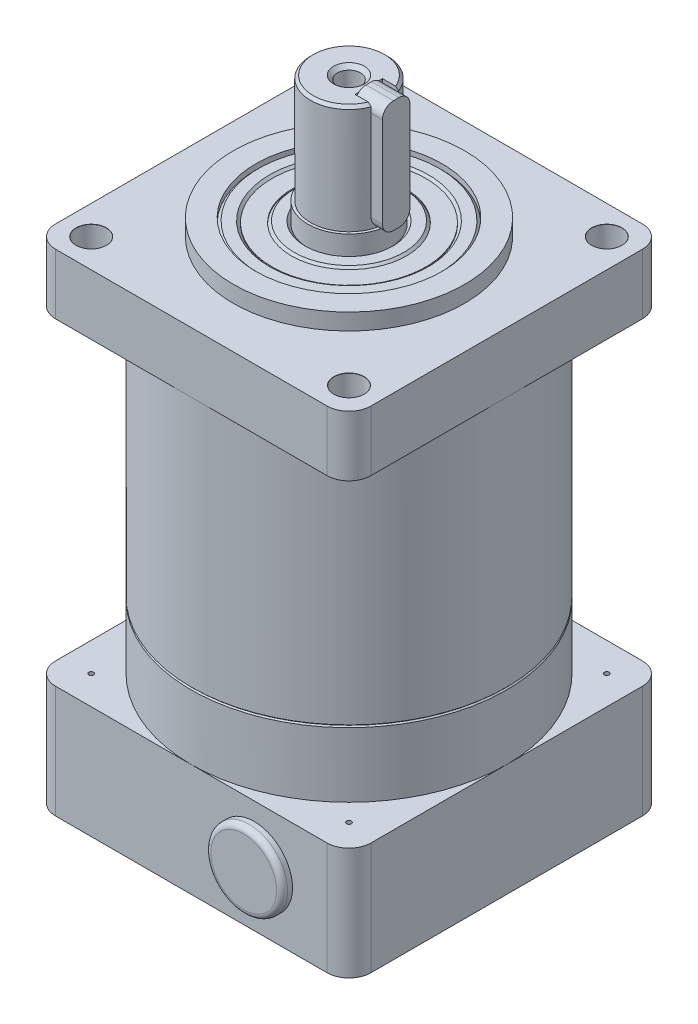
from build123d import *

# Parameters (mm, degrees)
SKETCH_1_W                       = 57.5
SKETCH_1_H                       = 57.5
EXTRUDE_1_DEPTH                  = 20.5
SKETCH_2_R                       = 28.75
EXTRUDE_2_DEPTH                  = 58
EXTRUDE_START                    = 78.5
SKETCH_1_2_W                     = 57.5
SKETCH_1_2_H                     = 57.5
EXTRUDE_3_DEPTH                  = 11
FILLET_1_R                       = 4
SKETCH_3_R                       = 19
CUT_EXTRUDE_1_DEPTH              = 4.5
SKETCH_4_R                       = 19
CUT_EXTRUDE_2_DEPTH              = 19
CUT_EXTRUDE_3_DEPTH              = 0.7
CUT_EXTRUDE_4_DEPTH              = 22
CUT_EXTRUDE_5_REACH              = 112.196
CUT_EXTRUDE_5_END_RADIUS         = 19
SKETCH_7_R                       = 4
SKETCH_8_R                       = 3.25
CUT_EXTRUDE_6_DEPTH              = 24.5
SKETCH_9_R                       = 3
EXTRUDE_5_DEPTH                  = 5
SKETCH_13_R                      = 17
SKETCH_13_R_2                    = 14
SKETCH_13_R_3                    = 10.5
SKETCH_13_R_4                    = 7.5
EXTRUDE_8_DEPTH                  = 2.5
CHAMFER_1_SIZE                   = 0.5
SKETCH_13_5_R                    = 7.5
SKETCH_13_5_R_2                  = 7
EXTRUDE_9_DEPTH                  = 5.7
SKETCH_13_6_R                    = 7
EXTRUDE_10_DEPTH                 = 25.5
SKETCH_13_7_R                    = 14
SKETCH_13_7_R_2                  = 10.5
EXTRUDE_11_DEPTH                 = 2.2
SKETCH_13_8_R                    = 21.1
SKETCH_13_8_R_2                  = 17
EXTRUDE_12_DEPTH                 = 3
CHAMFER_2_SIZE                   = 0.5
HOLE_WIZARD_M51_D                = 4.2
HOLE_WIZARD_M51_DEPTH            = 19.5
HOLE_WIZARD_M51_CSINK_D          = 5.6
HOLE_WIZARD_M51_CSINK_ANGLE      = 90
HOLE_WIZARD_M51_TIP              = 1.2618073
CUT_EXTRUDE_7_REACH              = 127.576
CUT_EXTRUDE_START                = 3.6
EXTRUDE_13_DEPTH                 = 5
HOLE_WIZARD_M52_D                = 4.2
HOLE_WIZARD_M52_DEPTH            = 19.5
HOLE_WIZARD_M52_CSINK_D          = 5.6
HOLE_WIZARD_M52_CSINK_ANGLE      = 90
HOLE_WIZARD_M52_TIP              = 1.2618073
HOLE_WIZARD_5_5_5_5_1_AT_2_COUNT = 2
HOLE_WIZARD_5_5_5_5_1_AT_2_PITCH = 47
HOLE_WIZARD_5_5_5_5_1_AT_3_COUNT = 2
HOLE_WIZARD_5_5_5_5_1_AT_3_PITCH = 47
HOLE_WIZARD_5_5_5_5_1_AT_4_COUNT = 2
HOLE_WIZARD_5_5_5_5_1_AT_4_PITCH = 66.468037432


with BuildPart() as part:
    # Sketch 1 → Extrude 1 (new body)
    with BuildSketch(Plane(origin=(0, 0, 0), x_dir=(1, 0, 0), z_dir=(0, 1, 0))):
        Rectangle(SKETCH_1_W, SKETCH_1_H)
    extrude(amount=EXTRUDE_1_DEPTH)

    # Sketch 2 → Extrude 2 (add)
    with BuildSketch(Plane(origin=(0, 20.5, 0), x_dir=(1, 0, 0), z_dir=(0, 1, 0))):
        with Locations(Location((0, 0, 0), (0, 0, 270))):
            Circle(SKETCH_2_R)
    extrude(amount=EXTRUDE_2_DEPTH)

    # Sketch 1_2 → Extrude 3 (add)
    with BuildSketch(Plane(origin=(0, 0, 0), x_dir=(1, 0, 0), z_dir=(0, 1, 0)).offset(EXTRUDE_START)):
        Rectangle(SKETCH_1_2_W, SKETCH_1_2_H)
    extrude(amount=EXTRUDE_3_DEPTH)

    # Fillet 1
    fillet_1_edges = [part.edges().sort_by_distance(p)[0] for p in [
        (-28.75, 84, -28.75),
        (-28.75, 84, 28.75),
        (28.75, 84, 28.75),
        (28.75, 84, -28.75),
        (28.75, 10.25, 28.75),
        (-28.75, 10.25, 28.75),
        (-28.75, 10.25, -28.75),
        (28.75, 10.25, -28.75),
    ]]
    fillet(fillet_1_edges, radius=FILLET_1_R)

    # Sketch 3 → Cut-Extrude 1 (cut)
    with BuildSketch(Plane.XZ):
        with Locations(Location((0, 0, 0), (0, 0, 270))):
            Circle(SKETCH_3_R)
    extrude(amount=-CUT_EXTRUDE_1_DEPTH, mode=Mode.SUBTRACT)

    # Sketch 4 → Cut-Extrude 2 (cut)
    # profile 1 of 11: a face of its own
    with BuildSketch(Plane.XZ.offset(-4.5)):
        with Locations(Location((0, 0, 0), (0, 0, 270))):
            Circle(SKETCH_4_R)
        with BuildLine():
            Line((16.973435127, 0.95), (5.924314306, 0.95))
            ThreePointArc((5.924314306, 0.95), (5.981048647, 0.476505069), (6, 0))
            ThreePointArc((6, 0), (5.981048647, -0.476505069), (5.924314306, -0.95))
            Line((5.924314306, -0.95), (16.973435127, -0.95))
            ThreePointArc((16.973435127, -0.95), (8.553286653, -14.691537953), (-7.553832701, -15.229563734))
            ThreePointArc((-7.553832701, -15.229563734), (-8.131727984, -8.131727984), (-15.229563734, -7.553832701))
            ThreePointArc((-15.229563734, -7.553832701), (-4.340399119, 16.436573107), (16.973435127, 0.95))
        make_face(mode=Mode.SUBTRACT)
    # profile 2 of 11: a face of its own
    with BuildSketch(Plane.XZ.offset(-4.5)):
        with BuildLine():
            Line((-5.924314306, 0.95), (-9.187533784, 0.95))
            ThreePointArc((-9.187533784, 0.95), (-14, 0), (-9.187533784, -0.95))
            Line((-9.187533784, -0.95), (-5.924314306, -0.95))
            ThreePointArc((-5.924314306, -0.95), (-6, 0), (-5.924314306, 0.95))
        make_face()
    # profile 3 of 11: a face of its own
    with BuildSketch(Plane.XZ.offset(-4.5)):
        with BuildLine():
            Line((-5.417333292, 0.95), (-5.924314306, 0.95))
            ThreePointArc((-5.924314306, 0.95), (-6, 0), (-5.924314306, -0.95))
            Line((-5.924314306, -0.95), (-5.417333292, -0.95))
            ThreePointArc((-5.417333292, -0.95), (-5.5, 0), (-5.417333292, 0.95))
        make_face()
    # profile 4 of 11: a face of its own
    with BuildSketch(Plane.XZ.offset(-4.5)):
        with BuildLine():
            ThreePointArc((6, 0), (5.981048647, 0.476505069), (5.924314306, 0.95))
            Line((5.924314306, 0.95), (5.417333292, 0.95))
            ThreePointArc((5.417333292, 0.95), (5.479294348, 0.476794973), (5.5, 0))
            ThreePointArc((5.5, 0), (5.479294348, -0.476794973), (5.417333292, -0.95))
            Line((5.417333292, -0.95), (5.924314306, -0.95))
            ThreePointArc((5.924314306, -0.95), (5.981048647, -0.476505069), (6, 0))
        make_face()
    # profile 5 of 11: a face of its own
    with BuildSketch(Plane.XZ.offset(-4.5)):
        with BuildLine():
            Line((-3.885550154, 0.95), (-5.417333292, 0.95))
            ThreePointArc((-5.417333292, 0.95), (-5.5, 0), (-5.417333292, -0.95))
            Line((-5.417333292, -0.95), (-3.885550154, -0.95))
            ThreePointArc((-3.885550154, -0.95), (-4, 0), (-3.885550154, 0.95))
        make_face()
    # profile 6 of 11: a face of its own
    with BuildSketch(Plane.XZ.offset(-4.5)):
        with BuildLine():
            ThreePointArc((5.5, 0), (5.479294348, 0.476794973), (5.417333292, 0.95))
            Line((5.417333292, 0.95), (3.885550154, 0.95))
            ThreePointArc((3.885550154, 0.95), (3.971284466, 0.478434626), (4, 0))
            ThreePointArc((4, 0), (3.971284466, -0.478434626), (3.885550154, -0.95))
            Line((3.885550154, -0.95), (5.417333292, -0.95))
            ThreePointArc((5.417333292, -0.95), (5.479294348, -0.476794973), (5.5, 0))
        make_face()
    # profile 7 of 11: a face of its own
    with BuildSketch(Plane.XZ.offset(-4.5)):
        with BuildLine():
            Line((3.885550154, 0.95), (-3.885550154, 0.95))
            ThreePointArc((-3.885550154, 0.95), (-4, 0), (-3.885550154, -0.95))
            Line((-3.885550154, -0.95), (3.885550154, -0.95))
            ThreePointArc((3.885550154, -0.95), (3.971284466, -0.478434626), (4, 0))
            ThreePointArc((4, 0), (3.971284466, 0.478434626), (3.885550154, 0.95))
        make_face()
    # profile 8 of 11: a face of its own
    with BuildSketch(Plane.XZ.offset(-4.5)):
        with BuildLine():
            Line((-3.885550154, 0.95), (-5.417333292, 0.95))
            ThreePointArc((-5.417333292, 0.95), (-5.5, 0), (-5.417333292, -0.95))
            Line((-5.417333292, -0.95), (-3.885550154, -0.95))
            ThreePointArc((-3.885550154, -0.95), (-4, 0), (-3.885550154, 0.95))
        make_face()
    # profile 9 of 11: a face of its own
    with BuildSketch(Plane.XZ.offset(-4.5)):
        with BuildLine():
            ThreePointArc((5.5, 0), (5.479294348, 0.476794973), (5.417333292, 0.95))
            Line((5.417333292, 0.95), (3.885550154, 0.95))
            ThreePointArc((3.885550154, 0.95), (3.971284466, 0.478434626), (4, 0))
            ThreePointArc((4, 0), (3.971284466, -0.478434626), (3.885550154, -0.95))
            Line((3.885550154, -0.95), (5.417333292, -0.95))
            ThreePointArc((5.417333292, -0.95), (5.479294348, -0.476794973), (5.5, 0))
        make_face()
    # profile 10 of 11: a face of its own
    with BuildSketch(Plane.XZ.offset(-4.5)):
        with BuildLine():
            Line((-5.417333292, 0.95), (-5.924314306, 0.95))
            ThreePointArc((-5.924314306, 0.95), (-6, 0), (-5.924314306, -0.95))
            Line((-5.924314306, -0.95), (-5.417333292, -0.95))
            ThreePointArc((-5.417333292, -0.95), (-5.5, 0), (-5.417333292, 0.95))
        make_face()
    # profile 11 of 11: a face of its own
    with BuildSketch(Plane.XZ.offset(-4.5)):
        with BuildLine():
            ThreePointArc((6, 0), (5.981048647, 0.476505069), (5.924314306, 0.95))
            Line((5.924314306, 0.95), (5.417333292, 0.95))
            ThreePointArc((5.417333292, 0.95), (5.479294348, 0.476794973), (5.5, 0))
            ThreePointArc((5.5, 0), (5.479294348, -0.476794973), (5.417333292, -0.95))
            Line((5.417333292, -0.95), (5.924314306, -0.95))
            ThreePointArc((5.924314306, -0.95), (5.981048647, -0.476505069), (6, 0))
        make_face()
    extrude(amount=-CUT_EXTRUDE_2_DEPTH, mode=Mode.SUBTRACT)

    # Sketch 4_3 → Cut-Extrude 3 (cut)
    with BuildSketch(Plane.XZ.offset(-4.5)):
        with BuildLine():
            Line((-3.885550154, -0.95), (-5.417333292, -0.95))
            ThreePointArc((-5.417333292, -0.95), (0, -5.5), (5.417333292, -0.95))
            Line((5.417333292, -0.95), (3.885550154, -0.95))
            ThreePointArc((3.885550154, -0.95), (0, -4), (-3.885550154, -0.95))
        make_face()
        with BuildLine():
            ThreePointArc((5.417333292, 0.95), (0, 5.5), (-5.417333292, 0.95))
            Line((-5.417333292, 0.95), (-3.885550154, 0.95))
            ThreePointArc((-3.885550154, 0.95), (0, 4), (3.885550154, 0.95))
            Line((3.885550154, 0.95), (5.417333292, 0.95))
        make_face()
        with BuildLine():
            Line((-3.885550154, 0.95), (-5.417333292, 0.95))
            ThreePointArc((-5.417333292, 0.95), (-5.5, 0), (-5.417333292, -0.95))
            Line((-5.417333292, -0.95), (-3.885550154, -0.95))
            ThreePointArc((-3.885550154, -0.95), (-4, 0), (-3.885550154, 0.95))
        make_face()
        with BuildLine():
            ThreePointArc((5.5, 0), (5.479294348, 0.476794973), (5.417333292, 0.95))
            Line((5.417333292, 0.95), (3.885550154, 0.95))
            ThreePointArc((3.885550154, 0.95), (3.971284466, 0.478434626), (4, 0))
            ThreePointArc((4, 0), (3.971284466, -0.478434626), (3.885550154, -0.95))
            Line((3.885550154, -0.95), (5.417333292, -0.95))
            ThreePointArc((5.417333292, -0.95), (5.479294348, -0.476794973), (5.5, 0))
        make_face()
        with BuildLine():
            Line((-3.885550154, 0.95), (-5.417333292, 0.95))
            ThreePointArc((-5.417333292, 0.95), (-5.5, 0), (-5.417333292, -0.95))
            Line((-5.417333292, -0.95), (-3.885550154, -0.95))
            ThreePointArc((-3.885550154, -0.95), (-4, 0), (-3.885550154, 0.95))
        make_face()
        with BuildLine():
            ThreePointArc((5.5, 0), (5.479294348, 0.476794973), (5.417333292, 0.95))
            Line((5.417333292, 0.95), (3.885550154, 0.95))
            ThreePointArc((3.885550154, 0.95), (3.971284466, 0.478434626), (4, 0))
            ThreePointArc((4, 0), (3.971284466, -0.478434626), (3.885550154, -0.95))
            Line((3.885550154, -0.95), (5.417333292, -0.95))
            ThreePointArc((5.417333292, -0.95), (5.479294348, -0.476794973), (5.5, 0))
        make_face()
    extrude(amount=-CUT_EXTRUDE_3_DEPTH, mode=Mode.SUBTRACT)

    # Sketch 4_4 → Cut-Extrude 4 (cut)
    with BuildSketch(Plane.XZ.offset(-4.5)):
        with BuildLine():
            Line((3.885550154, -0.95), (-3.885550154, -0.95))
            ThreePointArc((-3.885550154, -0.95), (0, -4), (3.885550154, -0.95))
        make_face()
        with BuildLine():
            ThreePointArc((3.885550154, 0.95), (0, 4), (-3.885550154, 0.95))
            Line((-3.885550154, 0.95), (3.885550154, 0.95))
        make_face()
        with BuildLine():
            Line((3.885550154, 0.95), (-3.885550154, 0.95))
            ThreePointArc((-3.885550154, 0.95), (-4, 0), (-3.885550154, -0.95))
            Line((-3.885550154, -0.95), (3.885550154, -0.95))
            ThreePointArc((3.885550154, -0.95), (3.971284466, -0.478434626), (4, 0))
            ThreePointArc((4, 0), (3.971284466, 0.478434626), (3.885550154, 0.95))
        make_face()
    extrude(amount=-CUT_EXTRUDE_4_DEPTH, mode=Mode.SUBTRACT)

    # Sketch 5 → Cut-Revolve 1 (revolve, cut)
    with BuildSketch(Plane(origin=(0, 0, 0), x_dir=(-1, 0, 0), z_dir=(0, 0, -1)), mode=Mode.PRIVATE) as cut_revolve_1_sk:
        Polygon((5.317333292, 5.2), (5.417333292, 5.3), (5.517333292, 5.3), (5.517333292, 4.6), (5.617333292, 4.5), (5.417333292, 4.5), (5.417333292, 5.2), align=None)
    revolve(cut_revolve_1_sk.sketch.rotate(Axis((0, 0, 0), (0, 1, 0)), 270), axis=Axis((0, 0, 0), (0, 1, 0)), mode=Mode.SUBTRACT)

    # Cut-Extrude 5: up to this cylinder (the profile starts outside it)
    cut_extrude_5_end = Plane(origin=(0, 10.25, 0), z_dir=(0, -1, 0)) * Cylinder(CUT_EXTRUDE_5_END_RADIUS, 263.392, mode=Mode.PRIVATE)
    # Sketch 7 → Cut-Extrude 5 (cut, up to the surface)
    with BuildSketch(Plane.XY.offset(28.75), mode=Mode.PRIVATE) as cut_extrude_5_sk1:
        with Locations((11.45, 10.25)):
            Circle(SKETCH_7_R)
    cut_extrude_5_tool1 = extrude(cut_extrude_5_sk1.sketch, amount=-CUT_EXTRUDE_5_REACH, mode=Mode.PRIVATE) - cut_extrude_5_end
    add(cut_extrude_5_tool1.solids().sort_by_distance((11.45, 10.25, 28.75))[0], mode=Mode.SUBTRACT)

    # Sketch 8 → Cut-Extrude 6 (cut)
    with BuildSketch(Plane.XY.offset(28.75)):
        with Locations((11.45, 10.25)):
            Circle(SKETCH_8_R)
    extrude(amount=-CUT_EXTRUDE_6_DEPTH, mode=Mode.SUBTRACT)

    # Sketch 9 → Extrude 5 (add)
    with BuildSketch(Plane.XY.offset(4.25)):
        with Locations((11.45, 10.25)):
            Circle(SKETCH_9_R)
        Polygon((11.45, 7.940598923), (13.45, 9.095299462), (13.45, 11.404700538), (11.45, 12.559401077), (9.45, 11.404700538), (9.45, 9.095299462), align=None, mode=Mode.SUBTRACT)
    extrude(amount=EXTRUDE_5_DEPTH)

    # Sketch 11 → Cut-Revolve 2 (revolve, cut)
    with BuildSketch(Plane(origin=(0, 0, 0), x_dir=(0, 0, -1), z_dir=(1, 0, 0)), mode=Mode.PRIVATE) as cut_revolve_2_sk:
        Polygon((-28.778139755, 32.75), (-28.528139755, 32.5), (-28.778139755, 32.25), align=None)
    revolve(cut_revolve_2_sk.sketch.rotate(Axis((0, 20.5, 0), (0, 1, 0)), 180), axis=Axis((0, 20.5, 0), (0, 1, 0)), mode=Mode.SUBTRACT)

    # Sketch 13 → Extrude 8 (add)
    # profile 1 of 2: a face of its own
    with BuildSketch(Plane(origin=(0, 89.5, 0), x_dir=(1, 0, 0), z_dir=(0, 1, 0))):
        with Locations(Location((0, 0, 0), (0, 0, 90))):
            Circle(SKETCH_13_R)
        with Locations(Location((0, 0, 0), (0, 0, 270))):
            Circle(SKETCH_13_R_2, mode=Mode.SUBTRACT)
    # profile 2 of 2: a face of its own
    with BuildSketch(Plane(origin=(0, 89.5, 0), x_dir=(1, 0, 0), z_dir=(0, 1, 0))):
        with Locations(Location((0, 0, 0), (0, 0, 90))):
            Circle(SKETCH_13_R_3)
        with Locations(Location((0, 0, 0), (0, 0, 270))):
            Circle(SKETCH_13_R_4, mode=Mode.SUBTRACT)
    extrude(amount=EXTRUDE_8_DEPTH)

    # Chamfer 1
    chamfer_1_edges = [part.edges().sort_by_distance(p)[0] for p in [
        (0, 92, -7.5),
        (0, 92, 10.5),
        (0, 92, -14),
        (0, 92, 17),
    ]]
    chamfer(chamfer_1_edges, length=CHAMFER_1_SIZE)

    # Sketch 13_5 → Extrude 9 (add)
    with BuildSketch(Plane(origin=(0, 89.5, 0), x_dir=(1, 0, 0), z_dir=(0, 1, 0))):
        with Locations(Location((0, 0, 0), (0, 0, 270))):
            Circle(SKETCH_13_5_R)
        with Locations(Location((0, 0, 0), (0, 0, 270))):
            Circle(SKETCH_13_5_R_2, mode=Mode.SUBTRACT)
    extrude(amount=EXTRUDE_9_DEPTH)

    # Sketch 13_6 → Extrude 10 (add)
    with BuildSketch(Plane(origin=(0, 89.5, 0), x_dir=(1, 0, 0), z_dir=(0, 1, 0))):
        with Locations(Location((0, 0, 0), (0, 0, 270))):
            Circle(SKETCH_13_6_R)
    extrude(amount=EXTRUDE_10_DEPTH)

    # Sketch 13_7 → Extrude 11 (add)
    with BuildSketch(Plane(origin=(0, 89.5, 0), x_dir=(1, 0, 0), z_dir=(0, 1, 0))):
        with Locations(Location((0, 0, 0), (0, 0, 270))):
            Circle(SKETCH_13_7_R)
        with Locations(Location((0, 0, 0), (0, 0, 270))):
            Circle(SKETCH_13_7_R_2, mode=Mode.SUBTRACT)
    extrude(amount=EXTRUDE_11_DEPTH)

    # Sketch 13_8 → Extrude 12 (add)
    with BuildSketch(Plane(origin=(0, 89.5, 0), x_dir=(1, 0, 0), z_dir=(0, 1, 0))):
        with Locations(Location((0, 0, 0), (0, 0, 90))):
            Circle(SKETCH_13_8_R)
        with Locations(Location((0, 0, 0), (0, 0, 270))):
            Circle(SKETCH_13_8_R_2, mode=Mode.SUBTRACT)
    extrude(amount=EXTRUDE_12_DEPTH)

    # Chamfer 2
    chamfer_2_edges = [part.edges().sort_by_distance(p)[0] for p in [
        (0, 115, -7),
    ]]
    chamfer(chamfer_2_edges, length=CHAMFER_2_SIZE)

    # Hole Wizard M51
    with Locations(Plane(origin=(0, 115, 0), x_dir=(1, 0, 0), z_dir=(0, 1, 0))):
        with Locations((0, 0)):
            CounterSinkHole(HOLE_WIZARD_M51_D / 2, HOLE_WIZARD_M51_CSINK_D / 2, depth=HOLE_WIZARD_M51_DEPTH, counter_sink_angle=HOLE_WIZARD_M51_CSINK_ANGLE)
            with Locations((0, 0, -(HOLE_WIZARD_M51_DEPTH + HOLE_WIZARD_M51_TIP / 2))):  # 118° drill point
                Cone(0, HOLE_WIZARD_M51_D / 2, HOLE_WIZARD_M51_TIP, mode=Mode.SUBTRACT)

    # Sketch 18 → Cut-Extrude 7 (cut, up to next)
    with BuildSketch(Plane(origin=(0, 0, 0), x_dir=(0, 0, -1), z_dir=(1, 0, 0)).offset(CUT_EXTRUDE_START), mode=Mode.PRIVATE) as cut_extrude_7_sk1:
        with BuildLine():
            Line((-2.5, 115), (-2.5, 97))
            ThreePointArc((-2.5, 97), (-1.914213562, 95.585786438), (-0.5, 95))
            Line((-0.5, 95), (0.5, 95))
            ThreePointArc((0.5, 95), (1.914213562, 95.585786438), (2.5, 97))
            Line((2.5, 97), (2.5, 115))
            Line((2.5, 115), (-2.5, 115))
        make_face()
    cut_extrude_7_tool1 = extrude(cut_extrude_7_sk1.sketch, amount=CUT_EXTRUDE_7_REACH, mode=Mode.PRIVATE) & part.part
    add(cut_extrude_7_tool1.solids().sort_by_distance((3.6, 105.166877, 0))[0], mode=Mode.SUBTRACT)

    # Sketch 19 → Extrude 13 (add)
    with BuildSketch(Plane(origin=(3.6, 0, 0), x_dir=(0, 0, -1), z_dir=(1, 0, 0))):
        with BuildLine():
            Line((-0.5, 115.5), (0.5, 115.5))
            ThreePointArc((0.5, 115.5), (1.914213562, 114.914213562), (2.5, 113.5))
            Line((2.5, 113.5), (2.5, 97))
            ThreePointArc((2.5, 97), (1.914213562, 95.585786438), (0.5, 95))
            Line((0.5, 95), (-0.5, 95))
            ThreePointArc((-0.5, 95), (-1.914213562, 95.585786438), (-2.5, 97))
            Line((-2.5, 97), (-2.5, 113.5))
            ThreePointArc((-2.5, 113.5), (-1.914213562, 114.914213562), (-0.5, 115.5))
        make_face()
    extrude(amount=EXTRUDE_13_DEPTH)

    # Sketch 20 → Revolve 1 (revolve)
    with BuildSketch(Plane(origin=(11.45, 0, 0), x_dir=(0, 0, -1), z_dir=(1, 0, 0)), mode=Mode.PRIVATE) as revolve_1_sk:
        with BuildLine():
            Line((-30.65, 10.25), (-30.65, 16.25))
            ThreePointArc((-30.65, 16.25), (-30.357106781, 16.957106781), (-29.65, 17.25))
            Line((-29.65, 17.25), (-28.75, 17.25))
            Line((-28.75, 17.25), (-28.75, 13.25))
            Line((-28.75, 13.25), (-27.25, 13.25))
            Line((-27.25, 13.25), (-27.25, 14.25))
            Line((-27.25, 14.25), (-26.25, 14.25))
            Line((-26.25, 14.25), (-24.65, 10.25))
            Line((-24.65, 10.25), (-30.65, 10.25))
        make_face()
    revolve(revolve_1_sk.sketch.rotate(Axis((11.45, 10.25, 28.75), (0, 0, -1)), 90), axis=Axis((11.45, 10.25, 28.75), (0, 0, -1)))

    # Hole Wizard M52
    with Locations(Plane(origin=(0, 0, 0), x_dir=(-1, 0, 0), z_dir=(0, -1, 0))):
        with Locations((23.5, -23.5), (-23.5, -23.5), (-23.5, 23.5), (23.5, 23.5)):
            CounterSinkHole(HOLE_WIZARD_M52_D / 2, HOLE_WIZARD_M52_CSINK_D / 2, depth=HOLE_WIZARD_M52_DEPTH, counter_sink_angle=HOLE_WIZARD_M52_CSINK_ANGLE)
            with Locations((0, 0, -(HOLE_WIZARD_M52_DEPTH + HOLE_WIZARD_M52_TIP / 2))):  # 118° drill point
                Cone(0, HOLE_WIZARD_M52_D / 2, HOLE_WIZARD_M52_TIP, mode=Mode.SUBTRACT)

    # Sketch 25 → Hole Wizard 5.5 _5.5_1 (revolve, cut)
    with BuildSketch(Plane(origin=(23.5, 78.5, 23.5), x_dir=(0, 0, -1), z_dir=(1, 0, 0))):
        Polygon((0, 0), (0, 11), (2.775, 11), (2.75, 10.975), (2.75, 0), align=None)
    hole_wizard_5_5_5_5_1 = revolve(axis=Axis((23.5, 72.15, 23.5), (0, 1, 0)), mode=Mode.SUBTRACT)

    # Hole Wizard 5.5 _5.5_1 at 2: Hole Wizard 5.5 _5.5_1 ×2
    with Locations(*[(-i * HOLE_WIZARD_5_5_5_5_1_AT_2_PITCH, 0, 0) for i in range(1, HOLE_WIZARD_5_5_5_5_1_AT_2_COUNT)]):
        add(hole_wizard_5_5_5_5_1, mode=Mode.SUBTRACT)

    # Hole Wizard 5.5 _5.5_1 at 3: Hole Wizard 5.5 _5.5_1 ×2
    with Locations(*[(0, 0, -i * HOLE_WIZARD_5_5_5_5_1_AT_3_PITCH) for i in range(1, HOLE_WIZARD_5_5_5_5_1_AT_3_COUNT)]):
        add(hole_wizard_5_5_5_5_1, mode=Mode.SUBTRACT)

    # Hole Wizard 5.5 _5.5_1 at 4: Hole Wizard 5.5 _5.5_1 ×2
    with Locations(*[Vector(-0.7071067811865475, 0, -0.7071067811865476) * (i * HOLE_WIZARD_5_5_5_5_1_AT_4_PITCH) for i in range(1, HOLE_WIZARD_5_5_5_5_1_AT_4_COUNT)]):
        add(hole_wizard_5_5_5_5_1, mode=Mode.SUBTRACT)


solid = part.part
